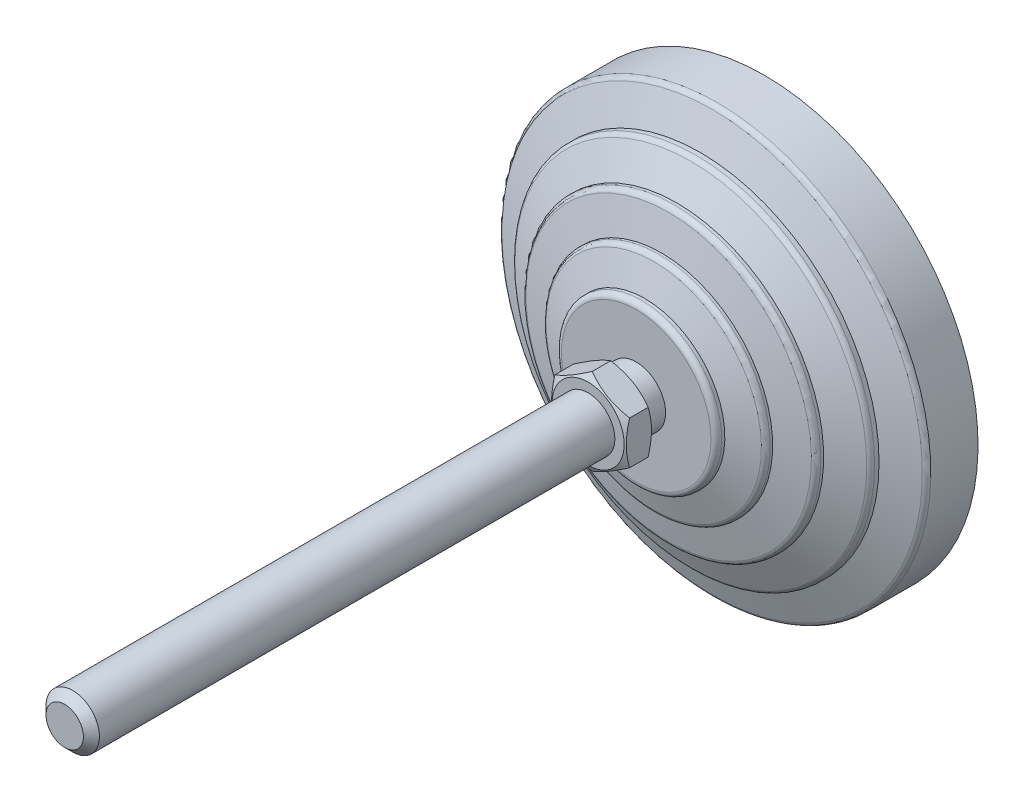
ISO-10303-21;
HEADER;
FILE_DESCRIPTION(('STEP AP214'),'2;1');
FILE_NAME('part.step','',(''),(''),'','','');
FILE_SCHEMA(('AUTOMOTIVE_DESIGN { 1 0 10303 214 1 1 1 1 }'));
ENDSEC;
DATA;
#1=APPLICATION_CONTEXT('core data for automotive mechanical design processes');
#2=APPLICATION_PROTOCOL_DEFINITION('international standard','automotive_design',2000,#1);
#3=PRODUCT_CONTEXT('',#1,'mechanical');
#4=PRODUCT('Part','Part','',(#3));
#5=PRODUCT_RELATED_PRODUCT_CATEGORY('part','',(#4));
#6=PRODUCT_DEFINITION_FORMATION('','',#4);
#7=PRODUCT_DEFINITION_CONTEXT('part definition',#1,'design');
#8=PRODUCT_DEFINITION('design','',#6,#7);
#9=PRODUCT_DEFINITION_SHAPE('','',#8);
#10=(LENGTH_UNIT() NAMED_UNIT(*) SI_UNIT(.MILLI.,.METRE.));
#11=(NAMED_UNIT(*) PLANE_ANGLE_UNIT() SI_UNIT($,.RADIAN.));
#12=(NAMED_UNIT(*) SI_UNIT($,.STERADIAN.) SOLID_ANGLE_UNIT());
#13=UNCERTAINTY_MEASURE_WITH_UNIT(LENGTH_MEASURE(1.E-05),#10,'distance_accuracy_value','');
#14=(GEOMETRIC_REPRESENTATION_CONTEXT(3) GLOBAL_UNCERTAINTY_ASSIGNED_CONTEXT((#13)) GLOBAL_UNIT_ASSIGNED_CONTEXT((#10,
#11,#12)) REPRESENTATION_CONTEXT('',''));
#15=CARTESIAN_POINT('',(0.,0.,0.));
#16=DIRECTION('',(0.,0.,1.));
#17=DIRECTION('',(1.,0.,0.));
#18=AXIS2_PLACEMENT_3D('',#15,#16,#17);
#19=CARTESIAN_POINT('',(-5.50000000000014,0.,28.));
#20=DIRECTION('',(0.,0.,1.));
#21=DIRECTION('',(0.,-1.,0.));
#22=AXIS2_PLACEMENT_3D('',#19,#20,#21);
#23=PLANE('',#22);
#24=CARTESIAN_POINT('',(0.,0.,28.));
#25=DIRECTION('',(0.,0.,-1.));
#26=DIRECTION('',(-1.,0.,0.));
#27=AXIS2_PLACEMENT_3D('',#24,#25,#26);
#28=CIRCLE('',#27,6.75);
#29=CARTESIAN_POINT('',(-6.75,0.,28.));
#30=VERTEX_POINT('',#29);
#31=EDGE_CURVE('E311',#30,#30,#28,.T.);
#32=ORIENTED_EDGE('',*,*,#31,.T.);
#33=EDGE_LOOP('',(#32));
#34=FACE_BOUND('',#33,.T.);
#35=CARTESIAN_POINT('',(0.,0.,28.));
#36=DIRECTION('',(0.,0.,-1.));
#37=DIRECTION('',(0.,1.,0.));
#38=AXIS2_PLACEMENT_3D('',#35,#36,#37);
#39=CIRCLE('',#38,5.50000000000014);
#40=CARTESIAN_POINT('',(0.,5.50000000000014,28.));
#41=VERTEX_POINT('',#40);
#42=EDGE_CURVE('E150',#41,#41,#39,.T.);
#43=ORIENTED_EDGE('',*,*,#42,.F.);
#44=EDGE_LOOP('',(#43));
#45=FACE_BOUND('',#44,.T.);
#46=ADVANCED_FACE('F14',(#34,#45),#23,.F.);
#47=CARTESIAN_POINT('',(0.,0.,0.));
#48=DIRECTION('',(0.,0.,-1.));
#49=DIRECTION('',(0.,1.,0.));
#50=AXIS2_PLACEMENT_3D('',#47,#48,#49);
#51=CYLINDRICAL_SURFACE('',#50,5.50000000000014);
#52=CARTESIAN_POINT('',(0.,0.,24.));
#53=DIRECTION('',(0.,0.,-1.));
#54=DIRECTION('',(0.,1.,0.));
#55=AXIS2_PLACEMENT_3D('',#52,#53,#54);
#56=CIRCLE('',#55,5.50000000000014);
#57=CARTESIAN_POINT('',(0.,5.50000000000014,24.));
#58=VERTEX_POINT('',#57);
#59=EDGE_CURVE('E147',#58,#58,#56,.T.);
#60=ORIENTED_EDGE('',*,*,#59,.F.);
#61=EDGE_LOOP('',(#60));
#62=FACE_BOUND('',#61,.T.);
#63=ORIENTED_EDGE('',*,*,#42,.T.);
#64=EDGE_LOOP('',(#63));
#65=FACE_BOUND('',#64,.T.);
#66=ADVANCED_FACE('F178',(#62,#65),#51,.T.);
#67=CARTESIAN_POINT('',(-5.50000000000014,0.,24.));
#68=DIRECTION('',(0.,0.,-1.));
#69=DIRECTION('',(0.,1.,0.));
#70=AXIS2_PLACEMENT_3D('',#67,#68,#69);
#71=PLANE('',#70);
#72=CARTESIAN_POINT('',(0.,0.,24.));
#73=DIRECTION('',(0.,0.,-1.));
#74=DIRECTION('',(0.,1.,0.));
#75=AXIS2_PLACEMENT_3D('',#72,#73,#74);
#76=CIRCLE('',#75,14.);
#77=CARTESIAN_POINT('',(0.,14.,24.));
#78=VERTEX_POINT('',#77);
#79=EDGE_CURVE('E144',#78,#78,#76,.T.);
#80=ORIENTED_EDGE('',*,*,#79,.F.);
#81=EDGE_LOOP('',(#80));
#82=FACE_BOUND('',#81,.T.);
#83=ORIENTED_EDGE('',*,*,#59,.T.);
#84=EDGE_LOOP('',(#83));
#85=FACE_BOUND('',#84,.T.);
#86=ADVANCED_FACE('F185',(#82,#85),#71,.F.);
#87=CARTESIAN_POINT('',(0.,0.,23.));
#88=DIRECTION('',(0.,0.,-1.));
#89=DIRECTION('',(0.,1.,0.));
#90=AXIS2_PLACEMENT_3D('',#87,#88,#89);
#91=TOROIDAL_SURFACE('',#90,14.,1.);
#92=CARTESIAN_POINT('',(0.,0.,23.));
#93=DIRECTION('',(0.,0.,-1.));
#94=DIRECTION('',(0.,1.,0.));
#95=AXIS2_PLACEMENT_3D('',#92,#93,#94);
#96=CIRCLE('',#95,15.);
#97=CARTESIAN_POINT('',(0.,15.,23.));
#98=VERTEX_POINT('',#97);
#99=EDGE_CURVE('E141',#98,#98,#96,.T.);
#100=ORIENTED_EDGE('',*,*,#99,.F.);
#101=EDGE_LOOP('',(#100));
#102=FACE_BOUND('',#101,.T.);
#103=ORIENTED_EDGE('',*,*,#79,.T.);
#104=EDGE_LOOP('',(#103));
#105=FACE_BOUND('',#104,.T.);
#106=ADVANCED_FACE('F524',(#102,#105),#91,.T.);
#107=CARTESIAN_POINT('',(0.,0.,0.));
#108=DIRECTION('',(0.,0.,-1.));
#109=DIRECTION('',(0.,1.,0.));
#110=AXIS2_PLACEMENT_3D('',#107,#108,#109);
#111=CYLINDRICAL_SURFACE('',#110,15.);
#112=CARTESIAN_POINT('',(0.,0.,22.4025287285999));
#113=DIRECTION('',(0.,0.,-1.));
#114=DIRECTION('',(0.,1.,0.));
#115=AXIS2_PLACEMENT_3D('',#112,#113,#114);
#116=CIRCLE('',#115,15.);
#117=CARTESIAN_POINT('',(0.,15.,22.4025287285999));
#118=VERTEX_POINT('',#117);
#119=EDGE_CURVE('E138',#118,#118,#116,.T.);
#120=ORIENTED_EDGE('',*,*,#119,.F.);
#121=EDGE_LOOP('',(#120));
#122=FACE_BOUND('',#121,.T.);
#123=ORIENTED_EDGE('',*,*,#99,.T.);
#124=EDGE_LOOP('',(#123));
#125=FACE_BOUND('',#124,.T.);
#126=ADVANCED_FACE('F515',(#122,#125),#111,.T.);
#127=CARTESIAN_POINT('',(0.,0.,22.4025287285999));
#128=DIRECTION('',(0.,0.,-1.));
#129=DIRECTION('',(0.,1.,0.));
#130=AXIS2_PLACEMENT_3D('',#127,#128,#129);
#131=CONICAL_SURFACE('',#130,15.,1.25589726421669);
#132=CARTESIAN_POINT('',(0.,0.,20.7216684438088));
#133=DIRECTION('',(0.,0.,-1.));
#134=DIRECTION('',(0.,1.,0.));
#135=AXIS2_PLACEMENT_3D('',#132,#133,#134);
#136=CIRCLE('',#135,20.1601635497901);
#137=CARTESIAN_POINT('',(0.,20.1601635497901,20.7216684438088));
#138=VERTEX_POINT('',#137);
#139=EDGE_CURVE('E135',#138,#138,#136,.T.);
#140=ORIENTED_EDGE('',*,*,#139,.F.);
#141=EDGE_LOOP('',(#140));
#142=FACE_BOUND('',#141,.T.);
#143=ORIENTED_EDGE('',*,*,#119,.T.);
#144=EDGE_LOOP('',(#143));
#145=FACE_BOUND('',#144,.T.);
#146=ADVANCED_FACE('F506',(#142,#145),#131,.T.);
#147=CARTESIAN_POINT('',(0.,0.,19.7708407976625));
#148=DIRECTION('',(0.,0.,-1.));
#149=DIRECTION('',(0.,1.,0.));
#150=AXIS2_PLACEMENT_3D('',#147,#148,#149);
#151=TOROIDAL_SURFACE('',#150,19.8504430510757,1.);
#152=CARTESIAN_POINT('',(0.,0.,19.7708407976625));
#153=DIRECTION('',(0.,0.,-1.));
#154=DIRECTION('',(0.,1.,0.));
#155=AXIS2_PLACEMENT_3D('',#152,#153,#154);
#156=CIRCLE('',#155,20.8504430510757);
#157=CARTESIAN_POINT('',(0.,20.8504430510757,19.7708407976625));
#158=VERTEX_POINT('',#157);
#159=EDGE_CURVE('E132',#158,#158,#156,.T.);
#160=ORIENTED_EDGE('',*,*,#159,.F.);
#161=EDGE_LOOP('',(#160));
#162=FACE_BOUND('',#161,.T.);
#163=ORIENTED_EDGE('',*,*,#139,.T.);
#164=EDGE_LOOP('',(#163));
#165=FACE_BOUND('',#164,.T.);
#166=ADVANCED_FACE('F497',(#162,#165),#151,.T.);
#167=CARTESIAN_POINT('',(0.,0.,0.));
#168=DIRECTION('',(0.,0.,-1.));
#169=DIRECTION('',(0.,1.,0.));
#170=AXIS2_PLACEMENT_3D('',#167,#168,#169);
#171=CYLINDRICAL_SURFACE('',#170,20.8504430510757);
#172=CARTESIAN_POINT('',(0.,0.,19.2987385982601));
#173=DIRECTION('',(0.,0.,-1.));
#174=DIRECTION('',(0.,1.,0.));
#175=AXIS2_PLACEMENT_3D('',#172,#173,#174);
#176=CIRCLE('',#175,20.8504430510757);
#177=CARTESIAN_POINT('',(0.,20.8504430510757,19.2987385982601));
#178=VERTEX_POINT('',#177);
#179=EDGE_CURVE('E129',#178,#178,#176,.T.);
#180=ORIENTED_EDGE('',*,*,#179,.F.);
#181=EDGE_LOOP('',(#180));
#182=FACE_BOUND('',#181,.T.);
#183=ORIENTED_EDGE('',*,*,#159,.T.);
#184=EDGE_LOOP('',(#183));
#185=FACE_BOUND('',#184,.T.);
#186=ADVANCED_FACE('F488',(#182,#185),#171,.T.);
#187=CARTESIAN_POINT('',(0.,0.,19.2987385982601));
#188=DIRECTION('',(0.,0.,-1.));
#189=DIRECTION('',(0.,1.,0.));
#190=AXIS2_PLACEMENT_3D('',#187,#188,#189);
#191=CONICAL_SURFACE('',#190,20.8504430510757,1.34067144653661);
#192=CARTESIAN_POINT('',(0.,0.,17.9217501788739));
#193=DIRECTION('',(0.,0.,-1.));
#194=DIRECTION('',(0.,1.,0.));
#195=AXIS2_PLACEMENT_3D('',#192,#193,#194);
#196=CIRCLE('',#195,26.7280991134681);
#197=CARTESIAN_POINT('',(0.,26.7280991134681,17.9217501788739));
#198=VERTEX_POINT('',#197);
#199=EDGE_CURVE('E126',#198,#198,#196,.T.);
#200=ORIENTED_EDGE('',*,*,#199,.F.);
#201=EDGE_LOOP('',(#200));
#202=FACE_BOUND('',#201,.T.);
#203=ORIENTED_EDGE('',*,*,#179,.T.);
#204=EDGE_LOOP('',(#203));
#205=FACE_BOUND('',#204,.T.);
#206=ADVANCED_FACE('F479',(#202,#205),#191,.T.);
#207=CARTESIAN_POINT('',(0.,0.,16.9481122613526));
#208=DIRECTION('',(0.,0.,-1.));
#209=DIRECTION('',(0.,1.,0.));
#210=AXIS2_PLACEMENT_3D('',#207,#208,#209);
#211=TOROIDAL_SURFACE('',#210,26.5,1.);
#212=CARTESIAN_POINT('',(0.,0.,16.9481122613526));
#213=DIRECTION('',(0.,0.,-1.));
#214=DIRECTION('',(0.,1.,0.));
#215=AXIS2_PLACEMENT_3D('',#212,#213,#214);
#216=CIRCLE('',#215,27.5);
#217=CARTESIAN_POINT('',(0.,27.5,16.9481122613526));
#218=VERTEX_POINT('',#217);
#219=EDGE_CURVE('E123',#218,#218,#216,.T.);
#220=ORIENTED_EDGE('',*,*,#219,.F.);
#221=EDGE_LOOP('',(#220));
#222=FACE_BOUND('',#221,.T.);
#223=ORIENTED_EDGE('',*,*,#199,.T.);
#224=EDGE_LOOP('',(#223));
#225=FACE_BOUND('',#224,.T.);
#226=ADVANCED_FACE('F470',(#222,#225),#211,.T.);
#227=CARTESIAN_POINT('',(0.,0.,0.));
#228=DIRECTION('',(0.,0.,-1.));
#229=DIRECTION('',(0.,1.,0.));
#230=AXIS2_PLACEMENT_3D('',#227,#228,#229);
#231=CYLINDRICAL_SURFACE('',#230,27.5);
#232=CARTESIAN_POINT('',(0.,0.,16.4025287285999));
#233=DIRECTION('',(0.,0.,-1.));
#234=DIRECTION('',(0.,1.,0.));
#235=AXIS2_PLACEMENT_3D('',#232,#233,#234);
#236=CIRCLE('',#235,27.5);
#237=CARTESIAN_POINT('',(0.,27.5,16.4025287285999));
#238=VERTEX_POINT('',#237);
#239=EDGE_CURVE('E120',#238,#238,#236,.T.);
#240=ORIENTED_EDGE('',*,*,#239,.F.);
#241=EDGE_LOOP('',(#240));
#242=FACE_BOUND('',#241,.T.);
#243=ORIENTED_EDGE('',*,*,#219,.T.);
#244=EDGE_LOOP('',(#243));
#245=FACE_BOUND('',#244,.T.);
#246=ADVANCED_FACE('F461',(#242,#245),#231,.T.);
#247=CARTESIAN_POINT('',(0.,0.,16.4025287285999));
#248=DIRECTION('',(0.,0.,-1.));
#249=DIRECTION('',(0.,1.,0.));
#250=AXIS2_PLACEMENT_3D('',#247,#248,#249);
#251=CONICAL_SURFACE('',#250,27.5,1.12022914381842);
#252=CARTESIAN_POINT('',(0.,0.,13.7730910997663));
#253=DIRECTION('',(0.,0.,-1.));
#254=DIRECTION('',(0.,1.,0.));
#255=AXIS2_PLACEMENT_3D('',#252,#253,#254);
#256=CIRCLE('',#255,32.9354761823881);
#257=CARTESIAN_POINT('',(0.,32.9354761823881,13.7730910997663));
#258=VERTEX_POINT('',#257);
#259=EDGE_CURVE('E117',#258,#258,#256,.T.);
#260=ORIENTED_EDGE('',*,*,#259,.F.);
#261=EDGE_LOOP('',(#260));
#262=FACE_BOUND('',#261,.T.);
#263=ORIENTED_EDGE('',*,*,#239,.T.);
#264=EDGE_LOOP('',(#263));
#265=FACE_BOUND('',#264,.T.);
#266=ADVANCED_FACE('F452',(#262,#265),#251,.T.);
#267=CARTESIAN_POINT('',(0.,0.,12.872890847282));
#268=DIRECTION('',(0.,0.,-1.));
#269=DIRECTION('',(0.,1.,0.));
#270=AXIS2_PLACEMENT_3D('',#267,#268,#269);
#271=TOROIDAL_SURFACE('',#270,32.5,1.);
#272=CARTESIAN_POINT('',(0.,0.,12.872890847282));
#273=DIRECTION('',(0.,0.,-1.));
#274=DIRECTION('',(0.,1.,0.));
#275=AXIS2_PLACEMENT_3D('',#272,#273,#274);
#276=CIRCLE('',#275,33.5);
#277=CARTESIAN_POINT('',(0.,33.5,12.872890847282));
#278=VERTEX_POINT('',#277);
#279=EDGE_CURVE('E114',#278,#278,#276,.T.);
#280=ORIENTED_EDGE('',*,*,#279,.F.);
#281=EDGE_LOOP('',(#280));
#282=FACE_BOUND('',#281,.T.);
#283=ORIENTED_EDGE('',*,*,#259,.T.);
#284=EDGE_LOOP('',(#283));
#285=FACE_BOUND('',#284,.T.);
#286=ADVANCED_FACE('F443',(#282,#285),#271,.T.);
#287=CARTESIAN_POINT('',(0.,0.,0.));
#288=DIRECTION('',(0.,0.,-1.));
#289=DIRECTION('',(0.,1.,0.));
#290=AXIS2_PLACEMENT_3D('',#287,#288,#289);
#291=CYLINDRICAL_SURFACE('',#290,33.5);
#292=CARTESIAN_POINT('',(0.,0.,12.0315037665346));
#293=DIRECTION('',(0.,0.,-1.));
#294=DIRECTION('',(0.,1.,0.));
#295=AXIS2_PLACEMENT_3D('',#292,#293,#294);
#296=CIRCLE('',#295,33.5);
#297=CARTESIAN_POINT('',(0.,33.5,12.0315037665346));
#298=VERTEX_POINT('',#297);
#299=EDGE_CURVE('E111',#298,#298,#296,.T.);
#300=ORIENTED_EDGE('',*,*,#299,.F.);
#301=EDGE_LOOP('',(#300));
#302=FACE_BOUND('',#301,.T.);
#303=ORIENTED_EDGE('',*,*,#279,.T.);
#304=EDGE_LOOP('',(#303));
#305=FACE_BOUND('',#304,.T.);
#306=ADVANCED_FACE('F434',(#302,#305),#291,.T.);
#307=CARTESIAN_POINT('',(0.,0.,12.0315037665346));
#308=DIRECTION('',(0.,0.,-1.));
#309=DIRECTION('',(0.,1.,0.));
#310=AXIS2_PLACEMENT_3D('',#307,#308,#309);
#311=CONICAL_SURFACE('',#310,33.5,1.20362249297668);
#312=CARTESIAN_POINT('',(0.,0.,9.77805027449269));
#313=DIRECTION('',(0.,0.,-1.));
#314=DIRECTION('',(0.,1.,0.));
#315=AXIS2_PLACEMENT_3D('',#312,#313,#314);
#316=CIRCLE('',#315,39.358979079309);
#317=CARTESIAN_POINT('',(0.,39.358979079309,9.77805027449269));
#318=VERTEX_POINT('',#317);
#319=EDGE_CURVE('E108',#318,#318,#316,.T.);
#320=ORIENTED_EDGE('',*,*,#319,.F.);
#321=EDGE_LOOP('',(#320));
#322=FACE_BOUND('',#321,.T.);
#323=ORIENTED_EDGE('',*,*,#299,.T.);
#324=EDGE_LOOP('',(#323));
#325=FACE_BOUND('',#324,.T.);
#326=ADVANCED_FACE('F425',(#322,#325),#311,.T.);
#327=CARTESIAN_POINT('',(0.,0.,8.84470466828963));
#328=DIRECTION('',(0.,0.,-1.));
#329=DIRECTION('',(0.,1.,0.));
#330=AXIS2_PLACEMENT_3D('',#327,#328,#329);
#331=TOROIDAL_SURFACE('',#330,39.,1.);
#332=CARTESIAN_POINT('',(0.,0.,8.84470466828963));
#333=DIRECTION('',(0.,0.,-1.));
#334=DIRECTION('',(0.,1.,0.));
#335=AXIS2_PLACEMENT_3D('',#332,#333,#334);
#336=CIRCLE('',#335,40.);
#337=CARTESIAN_POINT('',(0.,40.,8.84470466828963));
#338=VERTEX_POINT('',#337);
#339=EDGE_CURVE('E105',#338,#338,#336,.T.);
#340=ORIENTED_EDGE('',*,*,#339,.F.);
#341=EDGE_LOOP('',(#340));
#342=FACE_BOUND('',#341,.T.);
#343=ORIENTED_EDGE('',*,*,#319,.T.);
#344=EDGE_LOOP('',(#343));
#345=FACE_BOUND('',#344,.T.);
#346=ADVANCED_FACE('F416',(#342,#345),#331,.T.);
#347=CARTESIAN_POINT('',(0.,0.,0.));
#348=DIRECTION('',(0.,0.,-1.));
#349=DIRECTION('',(0.,1.,0.));
#350=AXIS2_PLACEMENT_3D('',#347,#348,#349);
#351=CYLINDRICAL_SURFACE('',#350,40.);
#352=CARTESIAN_POINT('',(0.,0.,0.));
#353=DIRECTION('',(0.,0.,-1.));
#354=DIRECTION('',(0.,1.,0.));
#355=AXIS2_PLACEMENT_3D('',#352,#353,#354);
#356=CIRCLE('',#355,40.);
#357=CARTESIAN_POINT('',(0.,40.,0.));
#358=VERTEX_POINT('',#357);
#359=EDGE_CURVE('E102',#358,#358,#356,.T.);
#360=ORIENTED_EDGE('',*,*,#359,.F.);
#361=EDGE_LOOP('',(#360));
#362=FACE_BOUND('',#361,.T.);
#363=ORIENTED_EDGE('',*,*,#339,.T.);
#364=EDGE_LOOP('',(#363));
#365=FACE_BOUND('',#364,.T.);
#366=ADVANCED_FACE('F409',(#362,#365),#351,.T.);
#367=CARTESIAN_POINT('',(0.,0.,0.));
#368=DIRECTION('',(0.,0.,1.));
#369=DIRECTION('',(0.,-1.,0.));
#370=AXIS2_PLACEMENT_3D('',#367,#368,#369);
#371=PLANE('',#370);
#372=ORIENTED_EDGE('',*,*,#359,.T.);
#373=EDGE_LOOP('',(#372));
#374=FACE_BOUND('',#373,.T.);
#375=ADVANCED_FACE('F175',(#374),#371,.F.);
#376=CARTESIAN_POINT('',(0.,0.,29.7125521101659));
#377=DIRECTION('',(0.,0.,1.));
#378=DIRECTION('',(1.,0.,0.));
#379=AXIS2_PLACEMENT_3D('',#376,#377,#378);
#380=CONICAL_SURFACE('',#379,9.71622726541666,1.0471975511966);
#381=CARTESIAN_POINT('',(0.000200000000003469,-8.0830192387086,28.7696190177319));
#382=CARTESIAN_POINT('',(-0.15366790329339,-7.99418356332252,28.7183374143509));
#383=CARTESIAN_POINT('',(-0.308109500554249,-7.90501666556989,28.669383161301));
#384=CARTESIAN_POINT('',(-0.618246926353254,-7.72595873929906,28.5767703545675));
#385=CARTESIAN_POINT('',(-0.773943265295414,-7.63606741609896,28.5331140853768));
#386=CARTESIAN_POINT('',(-1.24352516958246,-7.36495417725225,28.4109491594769));
#387=CARTESIAN_POINT('',(-1.5592643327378,-7.18266208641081,28.3414631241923));
#388=CARTESIAN_POINT('',(-2.03176224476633,-6.90986528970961,28.2599825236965));
#389=CARTESIAN_POINT('',(-2.18710922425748,-6.82017566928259,28.2367710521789));
#390=CARTESIAN_POINT('',(-2.49850511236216,-6.64039116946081,28.1978487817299));
#391=CARTESIAN_POINT('',(-2.65455395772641,-6.55029632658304,28.1821373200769));
#392=CARTESIAN_POINT('',(-2.96692267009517,-6.36995016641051,28.1586154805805));
#393=CARTESIAN_POINT('',(-3.12324202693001,-6.27969914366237,28.1507961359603));
#394=CARTESIAN_POINT('',(-3.43601650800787,-6.09911871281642,28.1432178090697));
#395=CARTESIAN_POINT('',(-3.59247162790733,-6.00878930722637,28.1434585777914));
#396=CARTESIAN_POINT('',(-4.02110687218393,-5.76131663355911,28.155197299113));
#397=CARTESIAN_POINT('',(-4.2931466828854,-5.60425437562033,28.1749033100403));
#398=CARTESIAN_POINT('',(-4.8354194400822,-5.29117305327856,28.2373910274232));
#399=CARTESIAN_POINT('',(-5.10565047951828,-5.13515508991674,28.2801940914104));
#400=CARTESIAN_POINT('',(-5.64901454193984,-4.82144370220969,28.3871892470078));
#401=CARTESIAN_POINT('',(-5.92207900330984,-4.6637898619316,28.4518346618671));
#402=CARTESIAN_POINT('',(-6.46413578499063,-4.35083323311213,28.5985536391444));
#403=CARTESIAN_POINT('',(-6.73313504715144,-4.19552643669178,28.680592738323));
#404=CARTESIAN_POINT('',(-7.0002,-4.04133641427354,28.7696190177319));
#405=B_SPLINE_CURVE_WITH_KNOTS('',3,(#381,#382,#383,#384,#385,#386,#387,#388,#389,#390,#391,
#392,#393,#394,#395,#396,#397,#398,#399,#400,#401,#402,#403,#404),.UNSPECIFIED.,.F.,.F.,(4,2,2,
2,2,2,2,2,2,2,2,4),(0.,0.554727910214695,1.10969417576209,2.2219327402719,2.76443041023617,
3.30688013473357,3.8487128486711,4.39052882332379,5.33376515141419,6.27787517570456,
7.2429241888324,8.20607866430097),.UNSPECIFIED.);
#406=CARTESIAN_POINT('',(0.,-8.08290376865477,28.7695523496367));
#407=VERTEX_POINT('',#406);
#408=CARTESIAN_POINT('',(-7.,-4.04145188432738,28.7695523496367));
#409=VERTEX_POINT('',#408);
#410=EDGE_CURVE('E73',#407,#409,#405,.T.);
#411=ORIENTED_EDGE('',*,*,#410,.T.);
#412=CARTESIAN_POINT('',(-7.,-10.829699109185,31.5478478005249));
#413=CARTESIAN_POINT('',(-7.,-10.5241803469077,31.3997490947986));
#414=CARTESIAN_POINT('',(-7.,-10.2179574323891,31.2530780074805));
#415=CARTESIAN_POINT('',(-7.,-9.6037287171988,30.9633945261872));
#416=CARTESIAN_POINT('',(-7.,-9.29572264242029,30.8203827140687));
#417=CARTESIAN_POINT('',(-7.,-8.67595352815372,30.5380961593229));
#418=CARTESIAN_POINT('',(-7.,-8.36417914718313,30.3988462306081));
#419=CARTESIAN_POINT('',(-7.,-7.73814151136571,30.1260800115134));
#420=CARTESIAN_POINT('',(-7.,-7.42387837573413,29.9925634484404));
#421=CARTESIAN_POINT('',(-7.,-6.78232253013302,29.7286481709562));
#422=CARTESIAN_POINT('',(-7.,-6.45493308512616,29.5984833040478));
#423=CARTESIAN_POINT('',(-7.,-5.79631511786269,29.34806833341));
#424=CARTESIAN_POINT('',(-7.,-5.46508616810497,29.2278193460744));
#425=CARTESIAN_POINT('',(-7.,-4.79888666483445,29.0004124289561));
#426=CARTESIAN_POINT('',(-7.,-4.46392533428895,28.8932277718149));
#427=CARTESIAN_POINT('',(-7.,-3.78921011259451,28.6954046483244));
#428=CARTESIAN_POINT('',(-7.,-3.4494577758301,28.6047609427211));
#429=CARTESIAN_POINT('',(-7.,-2.7667907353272,28.4448734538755));
#430=CARTESIAN_POINT('',(-7.,-2.42390371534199,28.3755146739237));
#431=CARTESIAN_POINT('',(-7.,-1.90647175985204,28.2904562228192));
#432=CARTESIAN_POINT('',(-7.,-1.73346463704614,28.2652655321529));
#433=CARTESIAN_POINT('',(-7.,-1.38659937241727,28.2217054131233));
#434=CARTESIAN_POINT('',(-7.,-1.21274131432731,28.2033353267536));
#435=CARTESIAN_POINT('',(-7.,-0.866666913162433,28.1740114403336));
#436=CARTESIAN_POINT('',(-7.,-0.694458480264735,28.1629646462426));
#437=CARTESIAN_POINT('',(-7.,-0.349728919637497,28.1481614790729));
#438=CARTESIAN_POINT('',(-7.,-0.177207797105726,28.1444049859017));
#439=CARTESIAN_POINT('',(-7.,0.167839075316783,28.1442719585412));
#440=CARTESIAN_POINT('',(-7.,0.340364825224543,28.1478954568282));
#441=CARTESIAN_POINT('',(-7.,0.68511103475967,28.1624343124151));
#442=CARTESIAN_POINT('',(-7.,0.857331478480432,28.1733500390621));
#443=CARTESIAN_POINT('',(-7.,1.27202376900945,28.2081838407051));
#444=CARTESIAN_POINT('',(-7.,1.5142074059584,28.235605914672));
#445=CARTESIAN_POINT('',(-7.,1.9967486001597,28.3033683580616));
#446=CARTESIAN_POINT('',(-7.,2.23710590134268,28.3437105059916));
#447=CARTESIAN_POINT('',(-7.,2.95517948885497,28.48197545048));
#448=CARTESIAN_POINT('',(-7.,3.42962376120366,28.5971107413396));
#449=CARTESIAN_POINT('',(-7.,4.13901201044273,28.7964079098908));
#450=CARTESIAN_POINT('',(-7.,4.37764451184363,28.8681926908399));
#451=CARTESIAN_POINT('',(-7.,4.85259111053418,29.0191289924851));
#452=CARTESIAN_POINT('',(-7.,5.08890519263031,29.0982805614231));
#453=CARTESIAN_POINT('',(-7.,5.55929102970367,29.262687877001));
#454=CARTESIAN_POINT('',(-7.,5.79336351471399,29.3479415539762));
#455=CARTESIAN_POINT('',(-7.,6.25957510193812,29.5235588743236));
#456=CARTESIAN_POINT('',(-7.,6.49171422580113,29.6139224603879));
#457=CARTESIAN_POINT('',(-7.,7.03551129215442,29.83139755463));
#458=CARTESIAN_POINT('',(-7.,7.34646390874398,29.9602693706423));
#459=CARTESIAN_POINT('',(-7.,7.96576068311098,30.2241527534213));
#460=CARTESIAN_POINT('',(-7.,8.27410468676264,30.3591646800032));
#461=CARTESIAN_POINT('',(-7.,8.88865877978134,30.6341064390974));
#462=CARTESIAN_POINT('',(-7.,9.19486844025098,30.7740372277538));
#463=CARTESIAN_POINT('',(-7.,9.80545837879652,31.0578416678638));
#464=CARTESIAN_POINT('',(-7.,10.1098386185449,31.2017154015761));
#465=CARTESIAN_POINT('',(-7.,10.7173770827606,31.4928207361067));
#466=CARTESIAN_POINT('',(-7.,11.0205337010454,31.6400556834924));
#467=CARTESIAN_POINT('',(-7.,11.6255483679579,31.9371722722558));
#468=CARTESIAN_POINT('',(-7.,11.9274064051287,32.0870539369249));
#469=CARTESIAN_POINT('',(-7.,12.8312625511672,32.5399319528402));
#470=CARTESIAN_POINT('',(-7.,13.4316215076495,32.8461993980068));
#471=CARTESIAN_POINT('',(-7.,14.5795857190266,33.4392767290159));
#472=CARTESIAN_POINT('',(-7.,15.127444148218,33.7255987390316));
#473=CARTESIAN_POINT('',(-7.,16.2211224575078,34.302152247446));
#474=CARTESIAN_POINT('',(-7.,16.766942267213,34.5923838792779));
#475=CARTESIAN_POINT('',(-7.,17.8556599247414,35.1751173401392));
#476=CARTESIAN_POINT('',(-7.,18.3985616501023,35.4676119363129));
#477=CARTESIAN_POINT('',(-7.,19.4830594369,36.0549431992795));
#478=CARTESIAN_POINT('',(-7.,20.0246555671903,36.3497797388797));
#479=CARTESIAN_POINT('',(-7.,20.5657700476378,36.6454917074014));
#480=B_SPLINE_CURVE_WITH_KNOTS('',3,(#412,#413,#414,#415,#416,#417,#418,#419,#420,#421,#422,
#423,#424,#425,#426,#427,#428,#429,#430,#431,#432,#433,#434,#435,#436,#437,#438,#439,#440,#441,
#442,#443,#444,#445,#446,#447,#448,#449,#450,#451,#452,#453,#454,#455,#456,#457,#458,#459,#460,
#461,#462,#463,#464,#465,#466,#467,#468,#469,#470,#471,#472,#473,#474,#475,#476,#477,#478,#479),
.UNSPECIFIED.,.F.,.F.,(4,2,2,2,2,2,2,2,2,2,2,2,2,2,2,2,2,2,2,2,2,2,2,2,2,2,2,2,2,2,2,2,2,4),(0.,
1.01857746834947,2.03731590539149,3.06164472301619,4.08592476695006,5.14274890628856,
6.19969186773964,7.25443485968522,8.30884318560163,9.35745024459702,9.88183128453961,
10.4061617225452,10.9236995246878,11.4412288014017,11.9587603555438,12.4763181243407,
13.2070981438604,13.9379788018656,15.400561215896,16.1480872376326,16.8956181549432,
17.6428967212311,18.3901669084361,19.3998780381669,20.4096484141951,21.4196161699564,
22.429605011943,23.4406475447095,24.4516989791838,26.473539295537,28.3280203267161,
30.182564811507,32.0326014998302,33.882538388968),.UNSPECIFIED.);
#481=CARTESIAN_POINT('',(-7.,4.04145188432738,28.7695523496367));
#482=VERTEX_POINT('',#481);
#483=EDGE_CURVE('E81',#409,#482,#480,.T.);
#484=ORIENTED_EDGE('',*,*,#483,.T.);
#485=CARTESIAN_POINT('',(-7.0002,4.04133641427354,28.7696190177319));
#486=CARTESIAN_POINT('',(-6.84633209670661,4.13017208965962,28.7183374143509));
#487=CARTESIAN_POINT('',(-6.69189049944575,4.21933898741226,28.669383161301));
#488=CARTESIAN_POINT('',(-6.38175307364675,4.39839691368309,28.5767703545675));
#489=CARTESIAN_POINT('',(-6.22605673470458,4.48828823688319,28.5331140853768));
#490=CARTESIAN_POINT('',(-5.75647483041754,4.75940147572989,28.4109491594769));
#491=CARTESIAN_POINT('',(-5.4407356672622,4.94169356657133,28.3414631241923));
#492=CARTESIAN_POINT('',(-4.96823775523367,5.21449036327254,28.2599825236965));
#493=CARTESIAN_POINT('',(-4.81289077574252,5.30417998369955,28.2367710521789));
#494=CARTESIAN_POINT('',(-4.50149488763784,5.48396448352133,28.1978487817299));
#495=CARTESIAN_POINT('',(-4.34544604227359,5.57405932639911,28.1821373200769));
#496=CARTESIAN_POINT('',(-4.03307732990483,5.75440548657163,28.1586154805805));
#497=CARTESIAN_POINT('',(-3.87675797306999,5.84465650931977,28.1507961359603));
#498=CARTESIAN_POINT('',(-3.56398349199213,6.02523694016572,28.1432178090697));
#499=CARTESIAN_POINT('',(-3.40752837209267,6.11556634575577,28.1434585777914));
#500=CARTESIAN_POINT('',(-2.97889312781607,6.36303901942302,28.155197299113));
#501=CARTESIAN_POINT('',(-2.7068533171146,6.52010127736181,28.1749033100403));
#502=CARTESIAN_POINT('',(-2.16458055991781,6.83318259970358,28.2373910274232));
#503=CARTESIAN_POINT('',(-1.89434952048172,6.9892005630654,28.2801940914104));
#504=CARTESIAN_POINT('',(-1.35098545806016,7.30291195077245,28.3871892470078));
#505=CARTESIAN_POINT('',(-1.07792099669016,7.46056579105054,28.4518346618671));
#506=CARTESIAN_POINT('',(-0.535864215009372,7.77352241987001,28.5985536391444));
#507=CARTESIAN_POINT('',(-0.266864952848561,7.92882921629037,28.680592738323));
#508=CARTESIAN_POINT('',(0.00019999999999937,8.0830192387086,28.7696190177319));
#509=B_SPLINE_CURVE_WITH_KNOTS('',3,(#485,#486,#487,#488,#489,#490,#491,#492,#493,#494,#495,
#496,#497,#498,#499,#500,#501,#502,#503,#504,#505,#506,#507,#508),.UNSPECIFIED.,.F.,.F.,(4,2,2,
2,2,2,2,2,2,2,2,4),(0.,0.554727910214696,1.10969417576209,2.2219327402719,2.76443041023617,
3.30688013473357,3.8487128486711,4.39052882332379,5.33376515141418,6.27787517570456,
7.2429241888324,8.20607866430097),.UNSPECIFIED.);
#510=CARTESIAN_POINT('',(0.,8.08290376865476,28.7695523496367));
#511=VERTEX_POINT('',#510);
#512=EDGE_CURVE('E278',#482,#511,#509,.T.);
#513=ORIENTED_EDGE('',*,*,#512,.T.);
#514=CARTESIAN_POINT('',(-0.000200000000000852,8.0830192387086,28.7696190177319));
#515=CARTESIAN_POINT('',(0.15366790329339,7.99418356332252,28.7183374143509));
#516=CARTESIAN_POINT('',(0.308109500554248,7.90501666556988,28.669383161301));
#517=CARTESIAN_POINT('',(0.618246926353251,7.72595873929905,28.5767703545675));
#518=CARTESIAN_POINT('',(0.773943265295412,7.63606741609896,28.5331140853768));
#519=CARTESIAN_POINT('',(1.24352516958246,7.36495417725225,28.4109491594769));
#520=CARTESIAN_POINT('',(1.5592643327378,7.18266208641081,28.3414631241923));
#521=CARTESIAN_POINT('',(2.03176224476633,6.9098652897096,28.2599825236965));
#522=CARTESIAN_POINT('',(2.18710922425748,6.82017566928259,28.2367710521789));
#523=CARTESIAN_POINT('',(2.49850511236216,6.64039116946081,28.1978487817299));
#524=CARTESIAN_POINT('',(2.6545539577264,6.55029632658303,28.1821373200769));
#525=CARTESIAN_POINT('',(2.96692267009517,6.36995016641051,28.1586154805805));
#526=CARTESIAN_POINT('',(3.12324202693,6.27969914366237,28.1507961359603));
#527=CARTESIAN_POINT('',(3.43601650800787,6.09911871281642,28.1432178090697));
#528=CARTESIAN_POINT('',(3.59247162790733,6.00878930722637,28.1434585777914));
#529=CARTESIAN_POINT('',(4.02110687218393,5.76131663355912,28.155197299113));
#530=CARTESIAN_POINT('',(4.2931466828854,5.60425437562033,28.1749033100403));
#531=CARTESIAN_POINT('',(4.83541944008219,5.29117305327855,28.2373910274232));
#532=CARTESIAN_POINT('',(5.10565047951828,5.13515508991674,28.2801940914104));
#533=CARTESIAN_POINT('',(5.64901454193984,4.82144370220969,28.3871892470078));
#534=CARTESIAN_POINT('',(5.92207900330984,4.66378986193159,28.4518346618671));
#535=CARTESIAN_POINT('',(6.46413578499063,4.35083323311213,28.5985536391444));
#536=CARTESIAN_POINT('',(6.73313504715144,4.19552643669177,28.680592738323));
#537=CARTESIAN_POINT('',(7.0002,4.04133641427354,28.7696190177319));
#538=B_SPLINE_CURVE_WITH_KNOTS('',3,(#514,#515,#516,#517,#518,#519,#520,#521,#522,#523,#524,
#525,#526,#527,#528,#529,#530,#531,#532,#533,#534,#535,#536,#537),.UNSPECIFIED.,.F.,.F.,(4,2,2,
2,2,2,2,2,2,2,2,4),(0.,0.554727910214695,1.10969417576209,2.2219327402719,2.76443041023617,
3.30688013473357,3.8487128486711,4.39052882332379,5.33376515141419,6.27787517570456,
7.2429241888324,8.20607866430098),.UNSPECIFIED.);
#539=CARTESIAN_POINT('',(7.,4.04145188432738,28.7695523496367));
#540=VERTEX_POINT('',#539);
#541=EDGE_CURVE('E279',#511,#540,#538,.T.);
#542=ORIENTED_EDGE('',*,*,#541,.T.);
#543=CARTESIAN_POINT('',(7.,-10.8296991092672,31.5478478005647));
#544=CARTESIAN_POINT('',(7.,-10.5241803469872,31.3997490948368));
#545=CARTESIAN_POINT('',(7.,-10.2179574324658,31.2530780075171));
#546=CARTESIAN_POINT('',(7.,-9.60372871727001,30.9633945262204));
#547=CARTESIAN_POINT('',(7.,-9.29572264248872,30.8203827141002));
#548=CARTESIAN_POINT('',(7.,-8.67595352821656,30.5380961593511));
#549=CARTESIAN_POINT('',(7.,-8.36417914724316,30.3988462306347));
#550=CARTESIAN_POINT('',(7.,-7.73814151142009,30.1260800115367));
#551=CARTESIAN_POINT('',(7.,-7.42387837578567,29.992563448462));
#552=CARTESIAN_POINT('',(7.,-6.78232253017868,29.7286481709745));
#553=CARTESIAN_POINT('',(7.,-6.45493308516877,29.5984833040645));
#554=CARTESIAN_POINT('',(7.,-5.79631511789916,29.3480683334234));
#555=CARTESIAN_POINT('',(7.,-5.46508616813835,29.2278193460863));
#556=CARTESIAN_POINT('',(7.,-4.79888666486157,29.0004124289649));
#557=CARTESIAN_POINT('',(7.,-4.46392533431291,28.8932277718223));
#558=CARTESIAN_POINT('',(7.,-3.78921011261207,28.6954046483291));
#559=CARTESIAN_POINT('',(7.,-3.44945777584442,28.6047609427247));
#560=CARTESIAN_POINT('',(7.,-2.76679073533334,28.4448734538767));
#561=CARTESIAN_POINT('',(7.,-2.42390371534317,28.3755146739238));
#562=CARTESIAN_POINT('',(7.,-1.90647175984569,28.2904562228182));
#563=CARTESIAN_POINT('',(7.,-1.73346463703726,28.2652655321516));
#564=CARTESIAN_POINT('',(7.,-1.38659937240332,28.2217054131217));
#565=CARTESIAN_POINT('',(7.,-1.21274131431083,28.203335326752));
#566=CARTESIAN_POINT('',(7.,-0.866666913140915,28.174011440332));
#567=CARTESIAN_POINT('',(7.,-0.694458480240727,28.1629646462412));
#568=CARTESIAN_POINT('',(7.,-0.349728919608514,28.148161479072));
#569=CARTESIAN_POINT('',(7.,-0.17720779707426,28.1444049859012));
#570=CARTESIAN_POINT('',(7.,0.167839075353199,28.1442719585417));
#571=CARTESIAN_POINT('',(7.,0.340364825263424,28.1478954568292));
#572=CARTESIAN_POINT('',(7.,0.685111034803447,28.1624343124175));
#573=CARTESIAN_POINT('',(7.,0.857331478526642,28.1733500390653));
#574=CARTESIAN_POINT('',(7.,1.27202376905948,28.2081838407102));
#575=CARTESIAN_POINT('',(7.,1.5142074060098,28.2356059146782));
#576=CARTESIAN_POINT('',(7.,1.99674860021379,28.3033683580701));
#577=CARTESIAN_POINT('',(7.,2.23710590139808,28.3437105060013));
#578=CARTESIAN_POINT('',(7.,2.95517948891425,28.4819754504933));
#579=CARTESIAN_POINT('',(7.,3.42962376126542,28.5971107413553));
#580=CARTESIAN_POINT('',(7.,4.13901201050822,28.79640790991));
#581=CARTESIAN_POINT('',(7.,4.37764451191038,28.8681926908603));
#582=CARTESIAN_POINT('',(7.,4.85259111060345,29.0191289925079));
#583=CARTESIAN_POINT('',(7.,5.08890519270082,29.0982805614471));
#584=CARTESIAN_POINT('',(7.,5.55929102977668,29.2626878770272));
#585=CARTESIAN_POINT('',(7.,5.79336351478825,29.3479415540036));
#586=CARTESIAN_POINT('',(7.,6.25957510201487,29.5235588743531));
#587=CARTESIAN_POINT('',(7.,6.49171422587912,29.6139224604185));
#588=CARTESIAN_POINT('',(7.,7.03551129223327,29.8313975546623));
#589=CARTESIAN_POINT('',(7.,7.34646390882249,29.9602693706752));
#590=CARTESIAN_POINT('',(7.,7.96576068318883,30.2241527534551));
#591=CARTESIAN_POINT('',(7.,8.27410468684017,30.3591646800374));
#592=CARTESIAN_POINT('',(7.,8.88865877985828,30.6341064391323));
#593=CARTESIAN_POINT('',(7.,9.19486844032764,30.774037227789));
#594=CARTESIAN_POINT('',(7.,9.80545837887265,31.0578416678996));
#595=CARTESIAN_POINT('',(7.,10.1098386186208,31.2017154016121));
#596=CARTESIAN_POINT('',(7.,10.717377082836,31.4928207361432));
#597=CARTESIAN_POINT('',(7.,11.0205337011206,31.640055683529));
#598=CARTESIAN_POINT('',(7.,11.6255483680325,31.9371722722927));
#599=CARTESIAN_POINT('',(7.,11.9274064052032,32.0870539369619));
#600=CARTESIAN_POINT('',(7.,12.831262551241,32.5399319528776));
#601=CARTESIAN_POINT('',(7.,13.431621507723,32.8461993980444));
#602=CARTESIAN_POINT('',(7.,14.5795857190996,33.4392767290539));
#603=CARTESIAN_POINT('',(7.,15.127444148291,33.7255987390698));
#604=CARTESIAN_POINT('',(7.,16.2211224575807,34.3021522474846));
#605=CARTESIAN_POINT('',(7.,16.7669422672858,34.5923838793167));
#606=CARTESIAN_POINT('',(7.,17.8556599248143,35.1751173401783));
#607=CARTESIAN_POINT('',(7.,18.3985616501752,35.4676119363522));
#608=CARTESIAN_POINT('',(7.,19.4830594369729,36.0549431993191));
#609=CARTESIAN_POINT('',(7.,20.0246555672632,36.3497797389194));
#610=CARTESIAN_POINT('',(7.,20.5657700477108,36.6454917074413));
#611=B_SPLINE_CURVE_WITH_KNOTS('',3,(#543,#544,#545,#546,#547,#548,#549,#550,#551,#552,#553,
#554,#555,#556,#557,#558,#559,#560,#561,#562,#563,#564,#565,#566,#567,#568,#569,#570,#571,#572,
#573,#574,#575,#576,#577,#578,#579,#580,#581,#582,#583,#584,#585,#586,#587,#588,#589,#590,#591,
#592,#593,#594,#595,#596,#597,#598,#599,#600,#601,#602,#603,#604,#605,#606,#607,#608,#609,#610),
.UNSPECIFIED.,.F.,.F.,(4,2,2,2,2,2,2,2,2,2,2,2,2,2,2,2,2,2,2,2,2,2,2,2,2,2,2,2,2,2,2,2,2,4),(0.,
1.01857746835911,2.03731590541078,3.06164472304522,4.08592476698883,5.14274890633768,
6.19969186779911,7.254434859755,8.30884318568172,9.35745024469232,9.88183128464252,
10.4061617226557,10.9236995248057,11.4412288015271,11.9587603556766,12.4763181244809,
13.2070981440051,13.9379788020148,15.4005612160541,16.1480872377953,16.8956181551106,
17.6428967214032,18.3901669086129,19.3998780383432,20.4096484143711,21.4196161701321,
22.4296050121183,23.4406475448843,24.4516989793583,26.4735392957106,28.3280203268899,
30.182564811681,32.0326015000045,33.8825383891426),.UNSPECIFIED.);
#612=CARTESIAN_POINT('',(7.,-4.04145188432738,28.7695523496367));
#613=VERTEX_POINT('',#612);
#614=EDGE_CURVE('E34',#540,#613,#611,.F.);
#615=ORIENTED_EDGE('',*,*,#614,.T.);
#616=CARTESIAN_POINT('',(7.0002,-4.04133641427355,28.7696190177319));
#617=CARTESIAN_POINT('',(6.84633209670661,-4.13017208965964,28.7183374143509));
#618=CARTESIAN_POINT('',(6.69189049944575,-4.21933898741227,28.669383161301));
#619=CARTESIAN_POINT('',(6.38175307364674,-4.3983969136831,28.5767703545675));
#620=CARTESIAN_POINT('',(6.22605673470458,-4.4882882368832,28.5331140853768));
#621=CARTESIAN_POINT('',(5.75647483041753,-4.7594014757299,28.4109491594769));
#622=CARTESIAN_POINT('',(5.4407356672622,-4.94169356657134,28.3414631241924));
#623=CARTESIAN_POINT('',(4.96823775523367,-5.21449036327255,28.2599825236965));
#624=CARTESIAN_POINT('',(4.81289077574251,-5.30417998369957,28.2367710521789));
#625=CARTESIAN_POINT('',(4.50149488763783,-5.48396448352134,28.1978487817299));
#626=CARTESIAN_POINT('',(4.34544604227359,-5.57405932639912,28.1821373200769));
#627=CARTESIAN_POINT('',(4.03307732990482,-5.75440548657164,28.1586154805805));
#628=CARTESIAN_POINT('',(3.87675797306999,-5.84465650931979,28.1507961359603));
#629=CARTESIAN_POINT('',(3.56398349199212,-6.02523694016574,28.1432178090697));
#630=CARTESIAN_POINT('',(3.40752837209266,-6.11556634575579,28.1434585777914));
#631=CARTESIAN_POINT('',(2.97889312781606,-6.36303901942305,28.155197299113));
#632=CARTESIAN_POINT('',(2.7068533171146,-6.52010127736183,28.1749033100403));
#633=CARTESIAN_POINT('',(2.1645805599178,-6.8331825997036,28.2373910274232));
#634=CARTESIAN_POINT('',(1.89434952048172,-6.98920056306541,28.2801940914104));
#635=CARTESIAN_POINT('',(1.35098545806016,-7.30291195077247,28.3871892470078));
#636=CARTESIAN_POINT('',(1.07792099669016,-7.46056579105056,28.4518346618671));
#637=CARTESIAN_POINT('',(0.535864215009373,-7.77352241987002,28.5985536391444));
#638=CARTESIAN_POINT('',(0.266864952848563,-7.92882921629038,28.680592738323));
#639=CARTESIAN_POINT('',(-0.000199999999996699,-8.08301923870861,28.7696190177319));
#640=B_SPLINE_CURVE_WITH_KNOTS('',3,(#616,#617,#618,#619,#620,#621,#622,#623,#624,#625,#626,
#627,#628,#629,#630,#631,#632,#633,#634,#635,#636,#637,#638,#639),.UNSPECIFIED.,.F.,.F.,(4,2,2,
2,2,2,2,2,2,2,2,4),(0.,0.554727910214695,1.10969417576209,2.2219327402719,2.76443041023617,
3.30688013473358,3.8487128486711,4.39052882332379,5.33376515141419,6.27787517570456,
7.2429241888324,8.20607866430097),.UNSPECIFIED.);
#641=EDGE_CURVE('E9',#613,#407,#640,.T.);
#642=ORIENTED_EDGE('',*,*,#641,.T.);
#643=EDGE_LOOP('',(#411,#484,#513,#542,#615,#642));
#644=FACE_BOUND('',#643,.T.);
#645=ORIENTED_EDGE('',*,*,#31,.F.);
#646=EDGE_LOOP('',(#645));
#647=FACE_BOUND('',#646,.T.);
#648=ADVANCED_FACE('F71',(#644,#647),#380,.T.);
#649=CARTESIAN_POINT('',(-3.5,0.,131.));
#650=DIRECTION('',(0.,0.,-1.));
#651=DIRECTION('',(0.,1.,0.));
#652=AXIS2_PLACEMENT_3D('',#649,#650,#651);
#653=PLANE('',#652);
#654=CARTESIAN_POINT('',(0.,0.,131.));
#655=DIRECTION('',(0.,0.,-1.));
#656=DIRECTION('',(0.,1.,0.));
#657=AXIS2_PLACEMENT_3D('',#654,#655,#656);
#658=CIRCLE('',#657,3.5);
#659=CARTESIAN_POINT('',(0.,3.5,131.));
#660=VERTEX_POINT('',#659);
#661=EDGE_CURVE('E99',#660,#660,#658,.T.);
#662=ORIENTED_EDGE('',*,*,#661,.F.);
#663=EDGE_LOOP('',(#662));
#664=FACE_BOUND('',#663,.T.);
#665=ADVANCED_FACE('F164',(#664),#653,.F.);
#666=CARTESIAN_POINT('',(0.,0.,131.));
#667=DIRECTION('',(0.,0.,-1.));
#668=DIRECTION('',(0.,1.,0.));
#669=AXIS2_PLACEMENT_3D('',#666,#667,#668);
#670=CONICAL_SURFACE('',#669,3.5,0.785398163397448);
#671=CARTESIAN_POINT('',(0.,0.,129.5));
#672=DIRECTION('',(0.,0.,-1.));
#673=DIRECTION('',(0.,1.,0.));
#674=AXIS2_PLACEMENT_3D('',#671,#672,#673);
#675=CIRCLE('',#674,5.);
#676=CARTESIAN_POINT('',(0.,5.,129.5));
#677=VERTEX_POINT('',#676);
#678=EDGE_CURVE('E96',#677,#677,#675,.T.);
#679=ORIENTED_EDGE('',*,*,#678,.F.);
#680=EDGE_LOOP('',(#679));
#681=FACE_BOUND('',#680,.T.);
#682=ORIENTED_EDGE('',*,*,#661,.T.);
#683=EDGE_LOOP('',(#682));
#684=FACE_BOUND('',#683,.T.);
#685=ADVANCED_FACE('F159',(#681,#684),#670,.T.);
#686=CARTESIAN_POINT('',(0.,0.,0.));
#687=DIRECTION('',(0.,0.,-1.));
#688=DIRECTION('',(0.,1.,0.));
#689=AXIS2_PLACEMENT_3D('',#686,#687,#688);
#690=CYLINDRICAL_SURFACE('',#689,5.);
#691=CARTESIAN_POINT('',(0.,0.,33.));
#692=DIRECTION('',(0.,0.,-1.));
#693=DIRECTION('',(0.,1.,0.));
#694=AXIS2_PLACEMENT_3D('',#691,#692,#693);
#695=CIRCLE('',#694,5.);
#696=CARTESIAN_POINT('',(0.,5.,33.));
#697=VERTEX_POINT('',#696);
#698=EDGE_CURVE('E28',#697,#697,#695,.T.);
#699=ORIENTED_EDGE('',*,*,#698,.F.);
#700=EDGE_LOOP('',(#699));
#701=FACE_BOUND('',#700,.T.);
#702=ORIENTED_EDGE('',*,*,#678,.T.);
#703=EDGE_LOOP('',(#702));
#704=FACE_BOUND('',#703,.T.);
#705=ADVANCED_FACE('F16',(#701,#704),#690,.T.);
#706=CARTESIAN_POINT('',(-5.,0.,33.));
#707=DIRECTION('',(0.,0.,-1.));
#708=DIRECTION('',(0.,1.,0.));
#709=AXIS2_PLACEMENT_3D('',#706,#707,#708);
#710=PLANE('',#709);
#711=CARTESIAN_POINT('',(0.,0.,33.));
#712=DIRECTION('',(0.,0.,-1.));
#713=DIRECTION('',(-1.,0.,0.));
#714=AXIS2_PLACEMENT_3D('',#711,#712,#713);
#715=CIRCLE('',#714,6.75);
#716=CARTESIAN_POINT('',(-6.75,0.,33.));
#717=VERTEX_POINT('',#716);
#718=EDGE_CURVE('E80',#717,#717,#715,.T.);
#719=ORIENTED_EDGE('',*,*,#718,.F.);
#720=EDGE_LOOP('',(#719));
#721=FACE_BOUND('',#720,.T.);
#722=ORIENTED_EDGE('',*,*,#698,.T.);
#723=EDGE_LOOP('',(#722));
#724=FACE_BOUND('',#723,.T.);
#725=ADVANCED_FACE('F155',(#721,#724),#710,.F.);
#726=CARTESIAN_POINT('',(0.,0.,33.));
#727=DIRECTION('',(0.,0.,-1.));
#728=DIRECTION('',(-1.,0.,0.));
#729=AXIS2_PLACEMENT_3D('',#726,#727,#728);
#730=CONICAL_SURFACE('',#729,6.75,1.0471975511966);
#731=CARTESIAN_POINT('',(-7.0002,-4.04133641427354,32.2303809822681));
#732=CARTESIAN_POINT('',(-6.84633209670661,-4.13017208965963,32.2816625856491));
#733=CARTESIAN_POINT('',(-6.69189049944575,-4.21933898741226,32.330616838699));
#734=CARTESIAN_POINT('',(-6.38175307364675,-4.39839691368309,32.4232296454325));
#735=CARTESIAN_POINT('',(-6.22605673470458,-4.48828823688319,32.4668859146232));
#736=CARTESIAN_POINT('',(-5.75647483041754,-4.7594014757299,32.5890508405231));
#737=CARTESIAN_POINT('',(-5.4407356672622,-4.94169356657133,32.6585368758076));
#738=CARTESIAN_POINT('',(-4.96823775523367,-5.21449036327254,32.7400174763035));
#739=CARTESIAN_POINT('',(-4.81289077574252,-5.30417998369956,32.7632289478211));
#740=CARTESIAN_POINT('',(-4.50149488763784,-5.48396448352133,32.8021512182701));
#741=CARTESIAN_POINT('',(-4.3454460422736,-5.57405932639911,32.8178626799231));
#742=CARTESIAN_POINT('',(-4.03307732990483,-5.75440548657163,32.8413845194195));
#743=CARTESIAN_POINT('',(-3.87675797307,-5.84465650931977,32.8492038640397));
#744=CARTESIAN_POINT('',(-3.56398349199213,-6.02523694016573,32.8567821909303));
#745=CARTESIAN_POINT('',(-3.40752837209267,-6.11556634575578,32.8565414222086));
#746=CARTESIAN_POINT('',(-2.97889312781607,-6.36303901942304,32.844802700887));
#747=CARTESIAN_POINT('',(-2.70685331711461,-6.52010127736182,32.8250966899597));
#748=CARTESIAN_POINT('',(-2.16458055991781,-6.83318259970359,32.7626089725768));
#749=CARTESIAN_POINT('',(-1.89434952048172,-6.9892005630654,32.7198059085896));
#750=CARTESIAN_POINT('',(-1.35098545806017,-7.30291195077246,32.6128107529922));
#751=CARTESIAN_POINT('',(-1.07792099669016,-7.46056579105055,32.5481653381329));
#752=CARTESIAN_POINT('',(-0.535864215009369,-7.77352241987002,32.4014463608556));
#753=CARTESIAN_POINT('',(-0.266864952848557,-7.92882921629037,32.319407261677));
#754=CARTESIAN_POINT('',(0.000200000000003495,-8.0830192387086,32.2303809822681));
#755=B_SPLINE_CURVE_WITH_KNOTS('',3,(#731,#732,#733,#734,#735,#736,#737,#738,#739,#740,#741,
#742,#743,#744,#745,#746,#747,#748,#749,#750,#751,#752,#753,#754),.UNSPECIFIED.,.F.,.F.,(4,2,2,
2,2,2,2,2,2,2,2,4),(0.,0.554727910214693,1.10969417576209,2.2219327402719,2.76443041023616,
3.30688013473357,3.84871284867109,4.39052882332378,5.33376515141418,6.27787517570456,
7.2429241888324,8.20607866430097),.UNSPECIFIED.);
#756=CARTESIAN_POINT('',(-7.,-4.04145188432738,32.2304476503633));
#757=VERTEX_POINT('',#756);
#758=CARTESIAN_POINT('',(0.,-8.08290376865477,32.2304476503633));
#759=VERTEX_POINT('',#758);
#760=EDGE_CURVE('E88',#757,#759,#755,.T.);
#761=ORIENTED_EDGE('',*,*,#760,.T.);
#762=CARTESIAN_POINT('',(-0.00019999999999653,-8.08301923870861,32.2303809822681));
#763=CARTESIAN_POINT('',(0.153667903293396,-7.99418356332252,32.2816625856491));
#764=CARTESIAN_POINT('',(0.308109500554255,-7.90501666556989,32.330616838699));
#765=CARTESIAN_POINT('',(0.618246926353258,-7.72595873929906,32.4232296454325));
#766=CARTESIAN_POINT('',(0.773943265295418,-7.63606741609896,32.4668859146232));
#767=CARTESIAN_POINT('',(1.24352516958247,-7.36495417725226,32.5890508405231));
#768=CARTESIAN_POINT('',(1.5592643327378,-7.18266208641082,32.6585368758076));
#769=CARTESIAN_POINT('',(2.03176224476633,-6.90986528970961,32.7400174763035));
#770=CARTESIAN_POINT('',(2.18710922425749,-6.8201756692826,32.7632289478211));
#771=CARTESIAN_POINT('',(2.49850511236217,-6.64039116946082,32.8021512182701));
#772=CARTESIAN_POINT('',(2.65455395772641,-6.55029632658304,32.8178626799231));
#773=CARTESIAN_POINT('',(2.96692267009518,-6.36995016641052,32.8413845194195));
#774=CARTESIAN_POINT('',(3.12324202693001,-6.27969914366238,32.8492038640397));
#775=CARTESIAN_POINT('',(3.43601650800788,-6.09911871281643,32.8567821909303));
#776=CARTESIAN_POINT('',(3.59247162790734,-6.00878930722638,32.8565414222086));
#777=CARTESIAN_POINT('',(4.02110687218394,-5.76131663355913,32.844802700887));
#778=CARTESIAN_POINT('',(4.2931466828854,-5.60425437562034,32.8250966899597));
#779=CARTESIAN_POINT('',(4.8354194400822,-5.29117305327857,32.7626089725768));
#780=CARTESIAN_POINT('',(5.10565047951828,-5.13515508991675,32.7198059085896));
#781=CARTESIAN_POINT('',(5.64901454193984,-4.8214437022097,32.6128107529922));
#782=CARTESIAN_POINT('',(5.92207900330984,-4.6637898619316,32.5481653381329));
#783=CARTESIAN_POINT('',(6.46413578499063,-4.35083323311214,32.4014463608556));
#784=CARTESIAN_POINT('',(6.73313504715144,-4.19552643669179,32.319407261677));
#785=CARTESIAN_POINT('',(7.0002,-4.04133641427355,32.2303809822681));
#786=B_SPLINE_CURVE_WITH_KNOTS('',3,(#762,#763,#764,#765,#766,#767,#768,#769,#770,#771,#772,
#773,#774,#775,#776,#777,#778,#779,#780,#781,#782,#783,#784,#785),.UNSPECIFIED.,.F.,.F.,(4,2,2,
2,2,2,2,2,2,2,2,4),(0.,0.554727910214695,1.10969417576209,2.2219327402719,2.76443041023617,
3.30688013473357,3.8487128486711,4.39052882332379,5.33376515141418,6.27787517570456,
7.24292418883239,8.20607866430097),.UNSPECIFIED.);
#787=CARTESIAN_POINT('',(7.,-4.04145188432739,32.2304476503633));
#788=VERTEX_POINT('',#787);
#789=EDGE_CURVE('E86',#759,#788,#786,.T.);
#790=ORIENTED_EDGE('',*,*,#789,.T.);
#791=CARTESIAN_POINT('',(7.,-10.8296991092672,29.4521521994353));
#792=CARTESIAN_POINT('',(7.,-10.5241803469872,29.6002509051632));
#793=CARTESIAN_POINT('',(7.,-10.2179574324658,29.7469219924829));
#794=CARTESIAN_POINT('',(7.,-9.60372871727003,30.0366054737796));
#795=CARTESIAN_POINT('',(7.,-9.29572264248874,30.1796172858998));
#796=CARTESIAN_POINT('',(7.,-8.67595352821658,30.4619038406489));
#797=CARTESIAN_POINT('',(7.,-8.36417914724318,30.6011537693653));
#798=CARTESIAN_POINT('',(7.,-7.73814151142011,30.8739199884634));
#799=CARTESIAN_POINT('',(7.,-7.42387837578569,31.007436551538));
#800=CARTESIAN_POINT('',(7.,-6.7823225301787,31.2713518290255));
#801=CARTESIAN_POINT('',(7.,-6.45493308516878,31.4015166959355));
#802=CARTESIAN_POINT('',(7.,-5.79631511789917,31.6519316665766));
#803=CARTESIAN_POINT('',(7.,-5.46508616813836,31.7721806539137));
#804=CARTESIAN_POINT('',(7.,-4.79888666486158,31.9995875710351));
#805=CARTESIAN_POINT('',(7.,-4.46392533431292,32.1067722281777));
#806=CARTESIAN_POINT('',(7.,-3.78921011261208,32.3045953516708));
#807=CARTESIAN_POINT('',(7.,-3.44945777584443,32.3952390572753));
#808=CARTESIAN_POINT('',(7.,-2.76679073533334,32.5551265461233));
#809=CARTESIAN_POINT('',(7.,-2.42390371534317,32.6244853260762));
#810=CARTESIAN_POINT('',(7.,-1.90647175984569,32.7095437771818));
#811=CARTESIAN_POINT('',(7.,-1.73346463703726,32.7347344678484));
#812=CARTESIAN_POINT('',(7.,-1.38659937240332,32.7782945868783));
#813=CARTESIAN_POINT('',(7.,-1.21274131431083,32.796664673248));
#814=CARTESIAN_POINT('',(7.,-0.866666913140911,32.825988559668));
#815=CARTESIAN_POINT('',(7.,-0.694458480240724,32.8370353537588));
#816=CARTESIAN_POINT('',(7.,-0.349728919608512,32.8518385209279));
#817=CARTESIAN_POINT('',(7.,-0.177207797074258,32.8555950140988));
#818=CARTESIAN_POINT('',(7.,0.1678390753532,32.8557280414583));
#819=CARTESIAN_POINT('',(7.,0.340364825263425,32.8521045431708));
#820=CARTESIAN_POINT('',(7.,0.685111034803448,32.8375656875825));
#821=CARTESIAN_POINT('',(7.,0.857331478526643,32.8266499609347));
#822=CARTESIAN_POINT('',(7.,1.27202376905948,32.7918161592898));
#823=CARTESIAN_POINT('',(7.,1.5142074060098,32.7643940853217));
#824=CARTESIAN_POINT('',(7.,1.99674860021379,32.6966316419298));
#825=CARTESIAN_POINT('',(7.,2.23710590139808,32.6562894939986));
#826=CARTESIAN_POINT('',(7.,2.95517948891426,32.5180245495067));
#827=CARTESIAN_POINT('',(7.,3.42962376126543,32.4028892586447));
#828=CARTESIAN_POINT('',(7.,4.13901201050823,32.20359209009));
#829=CARTESIAN_POINT('',(7.,4.37764451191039,32.1318073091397));
#830=CARTESIAN_POINT('',(7.,4.85259111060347,31.9808710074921));
#831=CARTESIAN_POINT('',(7.,5.08890519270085,31.9017194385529));
#832=CARTESIAN_POINT('',(7.,5.55929102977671,31.7373121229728));
#833=CARTESIAN_POINT('',(7.,5.79336351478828,31.6520584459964));
#834=CARTESIAN_POINT('',(7.,6.2595751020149,31.4764411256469));
#835=CARTESIAN_POINT('',(7.,6.49171422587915,31.3860775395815));
#836=CARTESIAN_POINT('',(7.,7.0355112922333,31.1686024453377));
#837=CARTESIAN_POINT('',(7.,7.34646390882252,31.0397306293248));
#838=CARTESIAN_POINT('',(7.,7.96576068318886,30.7758472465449));
#839=CARTESIAN_POINT('',(7.,8.2741046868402,30.6408353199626));
#840=CARTESIAN_POINT('',(7.,8.88865877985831,30.3658935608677));
#841=CARTESIAN_POINT('',(7.,9.19486844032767,30.225962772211));
#842=CARTESIAN_POINT('',(7.,9.80545837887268,29.9421583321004));
#843=CARTESIAN_POINT('',(7.,10.1098386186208,29.7982845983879));
#844=CARTESIAN_POINT('',(7.,10.717377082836,29.5071792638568));
#845=CARTESIAN_POINT('',(7.,11.0205337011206,29.359944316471));
#846=CARTESIAN_POINT('',(7.,11.6255483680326,29.0628277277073));
#847=CARTESIAN_POINT('',(7.,11.9274064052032,28.9129460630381));
#848=CARTESIAN_POINT('',(7.,12.8312625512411,28.4600680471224));
#849=CARTESIAN_POINT('',(7.,13.431621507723,28.1538006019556));
#850=CARTESIAN_POINT('',(7.,14.5795857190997,27.5607232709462));
#851=CARTESIAN_POINT('',(7.,15.127444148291,27.2744012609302));
#852=CARTESIAN_POINT('',(7.,16.2211224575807,26.6978477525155));
#853=CARTESIAN_POINT('',(7.,16.7669422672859,26.4076161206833));
#854=CARTESIAN_POINT('',(7.,17.8556599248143,25.8248826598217));
#855=CARTESIAN_POINT('',(7.,18.3985616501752,25.5323880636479));
#856=CARTESIAN_POINT('',(7.,19.483059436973,24.9450568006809));
#857=CARTESIAN_POINT('',(7.,20.0246555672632,24.6502202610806));
#858=CARTESIAN_POINT('',(7.,20.5657700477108,24.3545082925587));
#859=B_SPLINE_CURVE_WITH_KNOTS('',3,(#791,#792,#793,#794,#795,#796,#797,#798,#799,#800,#801,
#802,#803,#804,#805,#806,#807,#808,#809,#810,#811,#812,#813,#814,#815,#816,#817,#818,#819,#820,
#821,#822,#823,#824,#825,#826,#827,#828,#829,#830,#831,#832,#833,#834,#835,#836,#837,#838,#839,
#840,#841,#842,#843,#844,#845,#846,#847,#848,#849,#850,#851,#852,#853,#854,#855,#856,#857,#858),
.UNSPECIFIED.,.F.,.F.,(4,2,2,2,2,2,2,2,2,2,2,2,2,2,2,2,2,2,2,2,2,2,2,2,2,2,2,2,2,2,2,2,2,4),(0.,
1.01857746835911,2.03731590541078,3.06164472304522,4.08592476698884,5.14274890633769,
6.19969186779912,7.25443485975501,8.30884318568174,9.35745024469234,9.88183128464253,
10.4061617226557,10.9236995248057,11.4412288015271,11.9587603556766,12.4763181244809,
13.2070981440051,13.9379788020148,15.4005612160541,16.1480872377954,16.8956181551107,
17.6428967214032,18.3901669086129,19.3998780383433,20.4096484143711,21.4196161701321,
22.4296050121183,23.4406475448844,24.4516989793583,26.4735392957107,28.3280203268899,
30.182564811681,32.0326015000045,33.8825383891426),.UNSPECIFIED.);
#860=CARTESIAN_POINT('',(7.,4.04145188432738,32.2304476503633));
#861=VERTEX_POINT('',#860);
#862=EDGE_CURVE('E204',#788,#861,#859,.T.);
#863=ORIENTED_EDGE('',*,*,#862,.T.);
#864=CARTESIAN_POINT('',(7.0002,4.04133641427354,32.2303809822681));
#865=CARTESIAN_POINT('',(6.84633209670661,4.13017208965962,32.2816625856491));
#866=CARTESIAN_POINT('',(6.69189049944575,4.21933898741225,32.330616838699));
#867=CARTESIAN_POINT('',(6.38175307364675,4.39839691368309,32.4232296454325));
#868=CARTESIAN_POINT('',(6.22605673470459,4.48828823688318,32.4668859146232));
#869=CARTESIAN_POINT('',(5.75647483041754,4.75940147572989,32.5890508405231));
#870=CARTESIAN_POINT('',(5.4407356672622,4.94169356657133,32.6585368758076));
#871=CARTESIAN_POINT('',(4.96823775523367,5.21449036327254,32.7400174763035));
#872=CARTESIAN_POINT('',(4.81289077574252,5.30417998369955,32.7632289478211));
#873=CARTESIAN_POINT('',(4.50149488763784,5.48396448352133,32.8021512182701));
#874=CARTESIAN_POINT('',(4.3454460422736,5.5740593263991,32.8178626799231));
#875=CARTESIAN_POINT('',(4.03307732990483,5.75440548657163,32.8413845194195));
#876=CARTESIAN_POINT('',(3.87675797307,5.84465650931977,32.8492038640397));
#877=CARTESIAN_POINT('',(3.56398349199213,6.02523694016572,32.8567821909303));
#878=CARTESIAN_POINT('',(3.40752837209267,6.11556634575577,32.8565414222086));
#879=CARTESIAN_POINT('',(2.97889312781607,6.36303901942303,32.844802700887));
#880=CARTESIAN_POINT('',(2.70685331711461,6.52010127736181,32.8250966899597));
#881=CARTESIAN_POINT('',(2.16458055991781,6.83318259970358,32.7626089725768));
#882=CARTESIAN_POINT('',(1.89434952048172,6.9892005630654,32.7198059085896));
#883=CARTESIAN_POINT('',(1.35098545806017,7.30291195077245,32.6128107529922));
#884=CARTESIAN_POINT('',(1.07792099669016,7.46056579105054,32.5481653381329));
#885=CARTESIAN_POINT('',(0.53586421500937,7.77352241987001,32.4014463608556));
#886=CARTESIAN_POINT('',(0.266864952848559,7.92882921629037,32.319407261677));
#887=CARTESIAN_POINT('',(-0.000200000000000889,8.0830192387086,32.2303809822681));
#888=B_SPLINE_CURVE_WITH_KNOTS('',3,(#864,#865,#866,#867,#868,#869,#870,#871,#872,#873,#874,
#875,#876,#877,#878,#879,#880,#881,#882,#883,#884,#885,#886,#887),.UNSPECIFIED.,.F.,.F.,(4,2,2,
2,2,2,2,2,2,2,2,4),(0.,0.554727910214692,1.10969417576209,2.22193274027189,2.76443041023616,
3.30688013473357,3.84871284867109,4.39052882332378,5.33376515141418,6.27787517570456,
7.2429241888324,8.20607866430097),.UNSPECIFIED.);
#889=CARTESIAN_POINT('',(0.,8.08290376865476,32.2304476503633));
#890=VERTEX_POINT('',#889);
#891=EDGE_CURVE('E235',#861,#890,#888,.T.);
#892=ORIENTED_EDGE('',*,*,#891,.T.);
#893=CARTESIAN_POINT('',(0.000199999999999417,8.0830192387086,32.2303809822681));
#894=CARTESIAN_POINT('',(-0.153667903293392,7.99418356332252,32.2816625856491));
#895=CARTESIAN_POINT('',(-0.30810950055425,7.90501666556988,32.330616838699));
#896=CARTESIAN_POINT('',(-0.618246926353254,7.72595873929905,32.4232296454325));
#897=CARTESIAN_POINT('',(-0.773943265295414,7.63606741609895,32.4668859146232));
#898=CARTESIAN_POINT('',(-1.24352516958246,7.36495417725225,32.5890508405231));
#899=CARTESIAN_POINT('',(-1.5592643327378,7.18266208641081,32.6585368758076));
#900=CARTESIAN_POINT('',(-2.03176224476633,6.9098652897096,32.7400174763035));
#901=CARTESIAN_POINT('',(-2.18710922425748,6.82017566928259,32.7632289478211));
#902=CARTESIAN_POINT('',(-2.49850511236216,6.64039116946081,32.8021512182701));
#903=CARTESIAN_POINT('',(-2.65455395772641,6.55029632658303,32.8178626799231));
#904=CARTESIAN_POINT('',(-2.96692267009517,6.36995016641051,32.8413845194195));
#905=CARTESIAN_POINT('',(-3.12324202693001,6.27969914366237,32.8492038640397));
#906=CARTESIAN_POINT('',(-3.43601650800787,6.09911871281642,32.8567821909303));
#907=CARTESIAN_POINT('',(-3.59247162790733,6.00878930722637,32.8565414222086));
#908=CARTESIAN_POINT('',(-4.02110687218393,5.76131663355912,32.844802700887));
#909=CARTESIAN_POINT('',(-4.2931466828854,5.60425437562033,32.8250966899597));
#910=CARTESIAN_POINT('',(-4.83541944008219,5.29117305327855,32.7626089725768));
#911=CARTESIAN_POINT('',(-5.10565047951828,5.13515508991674,32.7198059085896));
#912=CARTESIAN_POINT('',(-5.64901454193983,4.82144370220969,32.6128107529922));
#913=CARTESIAN_POINT('',(-5.92207900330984,4.66378986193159,32.5481653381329));
#914=CARTESIAN_POINT('',(-6.46413578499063,4.35083323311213,32.4014463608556));
#915=CARTESIAN_POINT('',(-6.73313504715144,4.19552643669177,32.319407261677));
#916=CARTESIAN_POINT('',(-7.0002,4.04133641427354,32.2303809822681));
#917=B_SPLINE_CURVE_WITH_KNOTS('',3,(#893,#894,#895,#896,#897,#898,#899,#900,#901,#902,#903,
#904,#905,#906,#907,#908,#909,#910,#911,#912,#913,#914,#915,#916),.UNSPECIFIED.,.F.,.F.,(4,2,2,
2,2,2,2,2,2,2,2,4),(0.,0.554727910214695,1.10969417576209,2.2219327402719,2.76443041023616,
3.30688013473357,3.84871284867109,4.39052882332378,5.33376515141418,6.27787517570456,
7.2429241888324,8.20607866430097),.UNSPECIFIED.);
#918=CARTESIAN_POINT('',(-7.,4.04145188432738,32.2304476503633));
#919=VERTEX_POINT('',#918);
#920=EDGE_CURVE('E242',#890,#919,#917,.T.);
#921=ORIENTED_EDGE('',*,*,#920,.T.);
#922=CARTESIAN_POINT('',(-7.,-10.829699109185,29.4521521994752));
#923=CARTESIAN_POINT('',(-7.,-10.5241803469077,29.6002509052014));
#924=CARTESIAN_POINT('',(-7.,-10.2179574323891,29.7469219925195));
#925=CARTESIAN_POINT('',(-7.,-9.60372871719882,30.0366054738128));
#926=CARTESIAN_POINT('',(-7.,-9.2957226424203,30.1796172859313));
#927=CARTESIAN_POINT('',(-7.,-8.67595352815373,30.4619038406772));
#928=CARTESIAN_POINT('',(-7.,-8.36417914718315,30.6011537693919));
#929=CARTESIAN_POINT('',(-7.,-7.73814151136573,30.8739199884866));
#930=CARTESIAN_POINT('',(-7.,-7.42387837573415,31.0074365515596));
#931=CARTESIAN_POINT('',(-7.,-6.78232253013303,31.2713518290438));
#932=CARTESIAN_POINT('',(-7.,-6.45493308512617,31.4015166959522));
#933=CARTESIAN_POINT('',(-7.,-5.7963151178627,31.65193166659));
#934=CARTESIAN_POINT('',(-7.,-5.46508616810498,31.7721806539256));
#935=CARTESIAN_POINT('',(-7.,-4.79888666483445,31.9995875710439));
#936=CARTESIAN_POINT('',(-7.,-4.46392533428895,32.1067722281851));
#937=CARTESIAN_POINT('',(-7.,-3.78921011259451,32.3045953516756));
#938=CARTESIAN_POINT('',(-7.,-3.4494577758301,32.3952390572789));
#939=CARTESIAN_POINT('',(-7.,-2.7667907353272,32.5551265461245));
#940=CARTESIAN_POINT('',(-7.,-2.42390371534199,32.6244853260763));
#941=CARTESIAN_POINT('',(-7.,-1.90647175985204,32.7095437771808));
#942=CARTESIAN_POINT('',(-7.,-1.73346463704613,32.7347344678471));
#943=CARTESIAN_POINT('',(-7.,-1.38659937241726,32.7782945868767));
#944=CARTESIAN_POINT('',(-7.,-1.21274131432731,32.7966646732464));
#945=CARTESIAN_POINT('',(-7.,-0.866666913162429,32.8259885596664));
#946=CARTESIAN_POINT('',(-7.,-0.694458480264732,32.8370353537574));
#947=CARTESIAN_POINT('',(-7.,-0.349728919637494,32.8518385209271));
#948=CARTESIAN_POINT('',(-7.,-0.177207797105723,32.8555950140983));
#949=CARTESIAN_POINT('',(-7.,0.167839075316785,32.8557280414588));
#950=CARTESIAN_POINT('',(-7.,0.340364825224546,32.8521045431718));
#951=CARTESIAN_POINT('',(-7.,0.685111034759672,32.8375656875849));
#952=CARTESIAN_POINT('',(-7.,0.857331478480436,32.8266499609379));
#953=CARTESIAN_POINT('',(-7.,1.27202376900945,32.791816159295));
#954=CARTESIAN_POINT('',(-7.,1.51420740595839,32.764394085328));
#955=CARTESIAN_POINT('',(-7.,1.9967486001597,32.6966316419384));
#956=CARTESIAN_POINT('',(-7.,2.23710590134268,32.6562894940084));
#957=CARTESIAN_POINT('',(-7.,2.95517948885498,32.51802454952));
#958=CARTESIAN_POINT('',(-7.,3.42962376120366,32.4028892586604));
#959=CARTESIAN_POINT('',(-7.,4.13901201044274,32.2035920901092));
#960=CARTESIAN_POINT('',(-7.,4.37764451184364,32.1318073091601));
#961=CARTESIAN_POINT('',(-7.,4.8525911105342,31.9808710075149));
#962=CARTESIAN_POINT('',(-7.,5.08890519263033,31.9017194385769));
#963=CARTESIAN_POINT('',(-7.,5.5592910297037,31.737312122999));
#964=CARTESIAN_POINT('',(-7.,5.79336351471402,31.6520584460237));
#965=CARTESIAN_POINT('',(-7.,6.25957510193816,31.4764411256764));
#966=CARTESIAN_POINT('',(-7.,6.49171422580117,31.3860775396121));
#967=CARTESIAN_POINT('',(-7.,7.03551129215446,31.16860244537));
#968=CARTESIAN_POINT('',(-7.,7.34646390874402,31.0397306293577));
#969=CARTESIAN_POINT('',(-7.,7.96576068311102,30.7758472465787));
#970=CARTESIAN_POINT('',(-7.,8.27410468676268,30.6408353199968));
#971=CARTESIAN_POINT('',(-7.,8.88865877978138,30.3658935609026));
#972=CARTESIAN_POINT('',(-7.,9.19486844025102,30.2259627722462));
#973=CARTESIAN_POINT('',(-7.,9.80545837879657,29.9421583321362));
#974=CARTESIAN_POINT('',(-7.,10.1098386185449,29.7982845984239));
#975=CARTESIAN_POINT('',(-7.,10.7173770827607,29.5071792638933));
#976=CARTESIAN_POINT('',(-7.,11.0205337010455,29.3599443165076));
#977=CARTESIAN_POINT('',(-7.,11.6255483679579,29.0628277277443));
#978=CARTESIAN_POINT('',(-7.,11.9274064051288,28.9129460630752));
#979=CARTESIAN_POINT('',(-7.,12.8312625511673,28.4600680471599));
#980=CARTESIAN_POINT('',(-7.,13.4316215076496,28.1538006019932));
#981=CARTESIAN_POINT('',(-7.,14.5795857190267,27.5607232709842));
#982=CARTESIAN_POINT('',(-7.,15.1274441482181,27.2744012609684));
#983=CARTESIAN_POINT('',(-7.,16.2211224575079,26.6978477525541));
#984=CARTESIAN_POINT('',(-7.,16.7669422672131,26.4076161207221));
#985=CARTESIAN_POINT('',(-7.,17.8556599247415,25.8248826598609));
#986=CARTESIAN_POINT('',(-7.,18.3985616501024,25.5323880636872));
#987=CARTESIAN_POINT('',(-7.,19.4830594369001,24.9450568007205));
#988=CARTESIAN_POINT('',(-7.,20.0246555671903,24.6502202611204));
#989=CARTESIAN_POINT('',(-7.,20.5657700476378,24.3545082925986));
#990=B_SPLINE_CURVE_WITH_KNOTS('',3,(#922,#923,#924,#925,#926,#927,#928,#929,#930,#931,#932,
#933,#934,#935,#936,#937,#938,#939,#940,#941,#942,#943,#944,#945,#946,#947,#948,#949,#950,#951,
#952,#953,#954,#955,#956,#957,#958,#959,#960,#961,#962,#963,#964,#965,#966,#967,#968,#969,#970,
#971,#972,#973,#974,#975,#976,#977,#978,#979,#980,#981,#982,#983,#984,#985,#986,#987,#988,#989),
.UNSPECIFIED.,.F.,.F.,(4,2,2,2,2,2,2,2,2,2,2,2,2,2,2,2,2,2,2,2,2,2,2,2,2,2,2,2,2,2,2,2,2,4),(0.,
1.01857746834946,2.03731590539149,3.06164472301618,4.08592476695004,5.14274890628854,
6.19969186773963,7.25443485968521,8.30884318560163,9.35745024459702,9.88183128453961,
10.4061617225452,10.9236995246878,11.4412288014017,11.9587603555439,12.4763181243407,
13.2070981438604,13.9379788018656,15.400561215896,16.1480872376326,16.8956181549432,
17.6428967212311,18.3901669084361,19.3998780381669,20.4096484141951,21.4196161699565,
22.429605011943,23.4406475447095,24.4516989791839,26.473539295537,28.3280203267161,
30.1825648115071,32.0326014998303,33.8825383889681),.UNSPECIFIED.);
#991=EDGE_CURVE('E92',#919,#757,#990,.F.);
#992=ORIENTED_EDGE('',*,*,#991,.T.);
#993=EDGE_LOOP('',(#761,#790,#863,#892,#921,#992));
#994=FACE_BOUND('',#993,.T.);
#995=ORIENTED_EDGE('',*,*,#718,.T.);
#996=EDGE_LOOP('',(#995));
#997=FACE_BOUND('',#996,.T.);
#998=ADVANCED_FACE('F192',(#994,#997),#730,.T.);
#999=CARTESIAN_POINT('',(0.,-8.08290376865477,28.));
#1000=DIRECTION('',(0.5,-0.866025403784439,0.));
#1001=DIRECTION('',(0.866025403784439,0.5,0.));
#1002=AXIS2_PLACEMENT_3D('',#999,#1000,#1001);
#1003=PLANE('',#1002);
#1004=ORIENTED_EDGE('',*,*,#641,.F.);
#1005=DIRECTION('',(0.,0.,1.));
#1006=VECTOR('',#1005,1.);
#1007=CARTESIAN_POINT('',(7.,-4.04145188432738,28.));
#1008=LINE('',#1007,#1006);
#1009=EDGE_CURVE('E87',#613,#788,#1008,.T.);
#1010=ORIENTED_EDGE('',*,*,#1009,.T.);
#1011=ORIENTED_EDGE('',*,*,#789,.F.);
#1012=DIRECTION('',(0.,0.,1.));
#1013=VECTOR('',#1012,1.);
#1014=CARTESIAN_POINT('',(0.,-8.08290376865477,28.));
#1015=LINE('',#1014,#1013);
#1016=EDGE_CURVE('E42',#407,#759,#1015,.T.);
#1017=ORIENTED_EDGE('',*,*,#1016,.F.);
#1018=EDGE_LOOP('',(#1004,#1010,#1011,#1017));
#1019=FACE_BOUND('',#1018,.T.);
#1020=ADVANCED_FACE('F84',(#1019),#1003,.T.);
#1021=CARTESIAN_POINT('',(7.,-4.04145188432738,28.));
#1022=DIRECTION('',(1.,0.,0.));
#1023=DIRECTION('',(0.,1.,0.));
#1024=AXIS2_PLACEMENT_3D('',#1021,#1022,#1023);
#1025=PLANE('',#1024);
#1026=ORIENTED_EDGE('',*,*,#614,.F.);
#1027=DIRECTION('',(0.,0.,1.));
#1028=VECTOR('',#1027,1.);
#1029=CARTESIAN_POINT('',(7.,4.04145188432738,28.));
#1030=LINE('',#1029,#1028);
#1031=EDGE_CURVE('E90',#540,#861,#1030,.T.);
#1032=ORIENTED_EDGE('',*,*,#1031,.T.);
#1033=ORIENTED_EDGE('',*,*,#862,.F.);
#1034=ORIENTED_EDGE('',*,*,#1009,.F.);
#1035=EDGE_LOOP('',(#1026,#1032,#1033,#1034));
#1036=FACE_BOUND('',#1035,.T.);
#1037=ADVANCED_FACE('F299',(#1036),#1025,.T.);
#1038=CARTESIAN_POINT('',(7.,4.04145188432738,28.));
#1039=DIRECTION('',(0.5,0.866025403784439,0.));
#1040=DIRECTION('',(-0.866025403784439,0.5,0.));
#1041=AXIS2_PLACEMENT_3D('',#1038,#1039,#1040);
#1042=PLANE('',#1041);
#1043=ORIENTED_EDGE('',*,*,#541,.F.);
#1044=DIRECTION('',(0.,0.,1.));
#1045=VECTOR('',#1044,1.);
#1046=CARTESIAN_POINT('',(0.,8.08290376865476,28.));
#1047=LINE('',#1046,#1045);
#1048=EDGE_CURVE('E320',#511,#890,#1047,.T.);
#1049=ORIENTED_EDGE('',*,*,#1048,.T.);
#1050=ORIENTED_EDGE('',*,*,#891,.F.);
#1051=ORIENTED_EDGE('',*,*,#1031,.F.);
#1052=EDGE_LOOP('',(#1043,#1049,#1050,#1051));
#1053=FACE_BOUND('',#1052,.T.);
#1054=ADVANCED_FACE('F272',(#1053),#1042,.T.);
#1055=CARTESIAN_POINT('',(0.,8.08290376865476,28.));
#1056=DIRECTION('',(-0.5,0.866025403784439,0.));
#1057=DIRECTION('',(-0.866025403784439,-0.5,0.));
#1058=AXIS2_PLACEMENT_3D('',#1055,#1056,#1057);
#1059=PLANE('',#1058);
#1060=ORIENTED_EDGE('',*,*,#512,.F.);
#1061=DIRECTION('',(0.,0.,1.));
#1062=VECTOR('',#1061,1.);
#1063=CARTESIAN_POINT('',(-7.,4.04145188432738,28.));
#1064=LINE('',#1063,#1062);
#1065=EDGE_CURVE('E276',#482,#919,#1064,.T.);
#1066=ORIENTED_EDGE('',*,*,#1065,.T.);
#1067=ORIENTED_EDGE('',*,*,#920,.F.);
#1068=ORIENTED_EDGE('',*,*,#1048,.F.);
#1069=EDGE_LOOP('',(#1060,#1066,#1067,#1068));
#1070=FACE_BOUND('',#1069,.T.);
#1071=ADVANCED_FACE('F266',(#1070),#1059,.T.);
#1072=CARTESIAN_POINT('',(-7.,4.04145188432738,28.));
#1073=DIRECTION('',(-1.,0.,0.));
#1074=DIRECTION('',(0.,-1.,0.));
#1075=AXIS2_PLACEMENT_3D('',#1072,#1073,#1074);
#1076=PLANE('',#1075);
#1077=ORIENTED_EDGE('',*,*,#483,.F.);
#1078=DIRECTION('',(0.,0.,1.));
#1079=VECTOR('',#1078,1.);
#1080=CARTESIAN_POINT('',(-7.,-4.04145188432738,28.));
#1081=LINE('',#1080,#1079);
#1082=EDGE_CURVE('E79',#409,#757,#1081,.T.);
#1083=ORIENTED_EDGE('',*,*,#1082,.T.);
#1084=ORIENTED_EDGE('',*,*,#991,.F.);
#1085=ORIENTED_EDGE('',*,*,#1065,.F.);
#1086=EDGE_LOOP('',(#1077,#1083,#1084,#1085));
#1087=FACE_BOUND('',#1086,.T.);
#1088=ADVANCED_FACE('F227',(#1087),#1076,.T.);
#1089=CARTESIAN_POINT('',(-7.,-4.04145188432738,28.));
#1090=DIRECTION('',(-0.5,-0.866025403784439,0.));
#1091=DIRECTION('',(0.866025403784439,-0.5,0.));
#1092=AXIS2_PLACEMENT_3D('',#1089,#1090,#1091);
#1093=PLANE('',#1092);
#1094=ORIENTED_EDGE('',*,*,#410,.F.);
#1095=ORIENTED_EDGE('',*,*,#1016,.T.);
#1096=ORIENTED_EDGE('',*,*,#760,.F.);
#1097=ORIENTED_EDGE('',*,*,#1082,.F.);
#1098=EDGE_LOOP('',(#1094,#1095,#1096,#1097));
#1099=FACE_BOUND('',#1098,.T.);
#1100=ADVANCED_FACE('F78',(#1099),#1093,.T.);
#1101=CLOSED_SHELL('',(#46,#66,#86,#106,#126,#146,#166,#186,#206,#226,#246,#266,#286,#306,#326,
#346,#366,#375,#648,#665,#685,#705,#725,#998,#1020,#1037,#1054,#1071,#1088,#1100));
#1102=MANIFOLD_SOLID_BREP('B1',#1101);
#1103=ADVANCED_BREP_SHAPE_REPRESENTATION('',(#18,#1102),#14);
#1104=SHAPE_DEFINITION_REPRESENTATION(#9,#1103);
ENDSEC;
END-ISO-10303-21;
